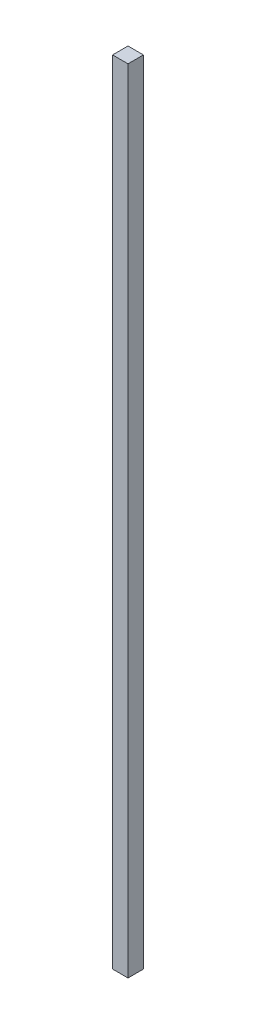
ISO-10303-21;
HEADER;
FILE_DESCRIPTION(('STEP AP214'),'2;1');
FILE_NAME('part.step','',(''),(''),'','','');
FILE_SCHEMA(('AUTOMOTIVE_DESIGN { 1 0 10303 214 1 1 1 1 }'));
ENDSEC;
DATA;
#1=APPLICATION_CONTEXT('core data for automotive mechanical design processes');
#2=APPLICATION_PROTOCOL_DEFINITION('international standard','automotive_design',2000,#1);
#3=PRODUCT_CONTEXT('',#1,'mechanical');
#4=PRODUCT('Part','Part','',(#3));
#5=PRODUCT_RELATED_PRODUCT_CATEGORY('part','',(#4));
#6=PRODUCT_DEFINITION_FORMATION('','',#4);
#7=PRODUCT_DEFINITION_CONTEXT('part definition',#1,'design');
#8=PRODUCT_DEFINITION('design','',#6,#7);
#9=PRODUCT_DEFINITION_SHAPE('','',#8);
#10=(LENGTH_UNIT() NAMED_UNIT(*) SI_UNIT(.MILLI.,.METRE.));
#11=(NAMED_UNIT(*) PLANE_ANGLE_UNIT() SI_UNIT($,.RADIAN.));
#12=(NAMED_UNIT(*) SI_UNIT($,.STERADIAN.) SOLID_ANGLE_UNIT());
#13=UNCERTAINTY_MEASURE_WITH_UNIT(LENGTH_MEASURE(1.E-05),#10,'distance_accuracy_value','');
#14=(GEOMETRIC_REPRESENTATION_CONTEXT(3) GLOBAL_UNCERTAINTY_ASSIGNED_CONTEXT((#13)) GLOBAL_UNIT_ASSIGNED_CONTEXT((#10,
#11,#12)) REPRESENTATION_CONTEXT('',''));
#15=CARTESIAN_POINT('',(0.,0.,0.));
#16=DIRECTION('',(0.,0.,1.));
#17=DIRECTION('',(1.,0.,0.));
#18=AXIS2_PLACEMENT_3D('',#15,#16,#17);
#19=CARTESIAN_POINT('',(30.,3080.,-30.));
#20=DIRECTION('',(-1.,0.,0.));
#21=DIRECTION('',(0.,0.,1.));
#22=AXIS2_PLACEMENT_3D('',#19,#20,#21);
#23=PLANE('',#22);
#24=DIRECTION('',(0.,0.,-1.));
#25=VECTOR('',#24,1.);
#26=CARTESIAN_POINT('',(30.,0.,-30.));
#27=LINE('',#26,#25);
#28=CARTESIAN_POINT('',(30.,0.,30.));
#29=VERTEX_POINT('',#28);
#30=CARTESIAN_POINT('',(30.,0.,-30.));
#31=VERTEX_POINT('',#30);
#32=EDGE_CURVE('E108',#29,#31,#27,.T.);
#33=ORIENTED_EDGE('',*,*,#32,.T.);
#34=DIRECTION('',(0.,-1.,0.));
#35=VECTOR('',#34,1.);
#36=CARTESIAN_POINT('',(30.,3080.,-30.));
#37=LINE('',#36,#35);
#38=CARTESIAN_POINT('',(30.,3080.,-30.));
#39=VERTEX_POINT('',#38);
#40=EDGE_CURVE('E11',#39,#31,#37,.T.);
#41=ORIENTED_EDGE('',*,*,#40,.F.);
#42=DIRECTION('',(0.,0.,-1.));
#43=VECTOR('',#42,1.);
#44=CARTESIAN_POINT('',(30.,3080.,-30.));
#45=LINE('',#44,#43);
#46=CARTESIAN_POINT('',(30.,3080.,30.));
#47=VERTEX_POINT('',#46);
#48=EDGE_CURVE('E96',#47,#39,#45,.T.);
#49=ORIENTED_EDGE('',*,*,#48,.F.);
#50=DIRECTION('',(0.,-1.,0.));
#51=VECTOR('',#50,1.);
#52=CARTESIAN_POINT('',(30.,3080.,30.));
#53=LINE('',#52,#51);
#54=EDGE_CURVE('E104',#47,#29,#53,.T.);
#55=ORIENTED_EDGE('',*,*,#54,.T.);
#56=EDGE_LOOP('',(#33,#41,#49,#55));
#57=FACE_BOUND('',#56,.T.);
#58=ADVANCED_FACE('F45',(#57),#23,.F.);
#59=CARTESIAN_POINT('',(-30.,3080.,-30.));
#60=DIRECTION('',(0.,0.,1.));
#61=DIRECTION('',(1.,0.,0.));
#62=AXIS2_PLACEMENT_3D('',#59,#60,#61);
#63=PLANE('',#62);
#64=DIRECTION('',(-1.,0.,0.));
#65=VECTOR('',#64,1.);
#66=CARTESIAN_POINT('',(-30.,0.,-30.));
#67=LINE('',#66,#65);
#68=CARTESIAN_POINT('',(-30.,0.,-30.));
#69=VERTEX_POINT('',#68);
#70=EDGE_CURVE('E100',#31,#69,#67,.T.);
#71=ORIENTED_EDGE('',*,*,#70,.T.);
#72=DIRECTION('',(0.,-1.,0.));
#73=VECTOR('',#72,1.);
#74=CARTESIAN_POINT('',(-30.,3080.,-30.));
#75=LINE('',#74,#73);
#76=CARTESIAN_POINT('',(-30.,3080.,-30.));
#77=VERTEX_POINT('',#76);
#78=EDGE_CURVE('E53',#77,#69,#75,.T.);
#79=ORIENTED_EDGE('',*,*,#78,.F.);
#80=DIRECTION('',(-1.,0.,0.));
#81=VECTOR('',#80,1.);
#82=CARTESIAN_POINT('',(-30.,3080.,-30.));
#83=LINE('',#82,#81);
#84=EDGE_CURVE('E91',#39,#77,#83,.T.);
#85=ORIENTED_EDGE('',*,*,#84,.F.);
#86=ORIENTED_EDGE('',*,*,#40,.T.);
#87=EDGE_LOOP('',(#71,#79,#85,#86));
#88=FACE_BOUND('',#87,.T.);
#89=ADVANCED_FACE('F99',(#88),#63,.F.);
#90=CARTESIAN_POINT('',(-30.,3080.,-30.));
#91=DIRECTION('',(1.,0.,0.));
#92=DIRECTION('',(0.,0.,-1.));
#93=AXIS2_PLACEMENT_3D('',#90,#91,#92);
#94=PLANE('',#93);
#95=DIRECTION('',(0.,0.,1.));
#96=VECTOR('',#95,1.);
#97=CARTESIAN_POINT('',(-30.,0.,-30.));
#98=LINE('',#97,#96);
#99=CARTESIAN_POINT('',(-30.,0.,30.));
#100=VERTEX_POINT('',#99);
#101=EDGE_CURVE('E78',#69,#100,#98,.T.);
#102=ORIENTED_EDGE('',*,*,#101,.T.);
#103=DIRECTION('',(0.,-1.,0.));
#104=VECTOR('',#103,1.);
#105=CARTESIAN_POINT('',(-30.,3080.,30.));
#106=LINE('',#105,#104);
#107=CARTESIAN_POINT('',(-30.,3080.,30.));
#108=VERTEX_POINT('',#107);
#109=EDGE_CURVE('E101',#108,#100,#106,.T.);
#110=ORIENTED_EDGE('',*,*,#109,.F.);
#111=DIRECTION('',(0.,0.,1.));
#112=VECTOR('',#111,1.);
#113=CARTESIAN_POINT('',(-30.,3080.,-30.));
#114=LINE('',#113,#112);
#115=EDGE_CURVE('E94',#77,#108,#114,.T.);
#116=ORIENTED_EDGE('',*,*,#115,.F.);
#117=ORIENTED_EDGE('',*,*,#78,.T.);
#118=EDGE_LOOP('',(#102,#110,#116,#117));
#119=FACE_BOUND('',#118,.T.);
#120=ADVANCED_FACE('F102',(#119),#94,.F.);
#121=CARTESIAN_POINT('',(-30.,3080.,30.));
#122=DIRECTION('',(0.,0.,-1.));
#123=DIRECTION('',(-1.,0.,0.));
#124=AXIS2_PLACEMENT_3D('',#121,#122,#123);
#125=PLANE('',#124);
#126=DIRECTION('',(1.,0.,0.));
#127=VECTOR('',#126,1.);
#128=CARTESIAN_POINT('',(-30.,0.,30.));
#129=LINE('',#128,#127);
#130=EDGE_CURVE('E84',#100,#29,#129,.T.);
#131=ORIENTED_EDGE('',*,*,#130,.T.);
#132=ORIENTED_EDGE('',*,*,#54,.F.);
#133=DIRECTION('',(1.,0.,0.));
#134=VECTOR('',#133,1.);
#135=CARTESIAN_POINT('',(-30.,3080.,30.));
#136=LINE('',#135,#134);
#137=EDGE_CURVE('E61',#108,#47,#136,.T.);
#138=ORIENTED_EDGE('',*,*,#137,.F.);
#139=ORIENTED_EDGE('',*,*,#109,.T.);
#140=EDGE_LOOP('',(#131,#132,#138,#139));
#141=FACE_BOUND('',#140,.T.);
#142=ADVANCED_FACE('F115',(#141),#125,.F.);
#143=CARTESIAN_POINT('',(0.,3080.,0.));
#144=DIRECTION('',(0.,1.,0.));
#145=DIRECTION('',(0.,0.,1.));
#146=AXIS2_PLACEMENT_3D('',#143,#144,#145);
#147=PLANE('',#146);
#148=ORIENTED_EDGE('',*,*,#48,.T.);
#149=ORIENTED_EDGE('',*,*,#84,.T.);
#150=ORIENTED_EDGE('',*,*,#115,.T.);
#151=ORIENTED_EDGE('',*,*,#137,.T.);
#152=EDGE_LOOP('',(#148,#149,#150,#151));
#153=FACE_BOUND('',#152,.T.);
#154=ADVANCED_FACE('F92',(#153),#147,.T.);
#155=CARTESIAN_POINT('',(0.,0.,0.));
#156=DIRECTION('',(0.,1.,0.));
#157=DIRECTION('',(0.,0.,1.));
#158=AXIS2_PLACEMENT_3D('',#155,#156,#157);
#159=PLANE('',#158);
#160=ORIENTED_EDGE('',*,*,#32,.F.);
#161=ORIENTED_EDGE('',*,*,#130,.F.);
#162=ORIENTED_EDGE('',*,*,#101,.F.);
#163=ORIENTED_EDGE('',*,*,#70,.F.);
#164=EDGE_LOOP('',(#160,#161,#162,#163));
#165=FACE_BOUND('',#164,.T.);
#166=ADVANCED_FACE('F118',(#165),#159,.F.);
#167=CLOSED_SHELL('',(#58,#89,#120,#142,#154,#166));
#168=MANIFOLD_SOLID_BREP('B2',#167);
#169=ADVANCED_BREP_SHAPE_REPRESENTATION('',(#18,#168),#14);
#170=SHAPE_DEFINITION_REPRESENTATION(#9,#169);
ENDSEC;
END-ISO-10303-21;
